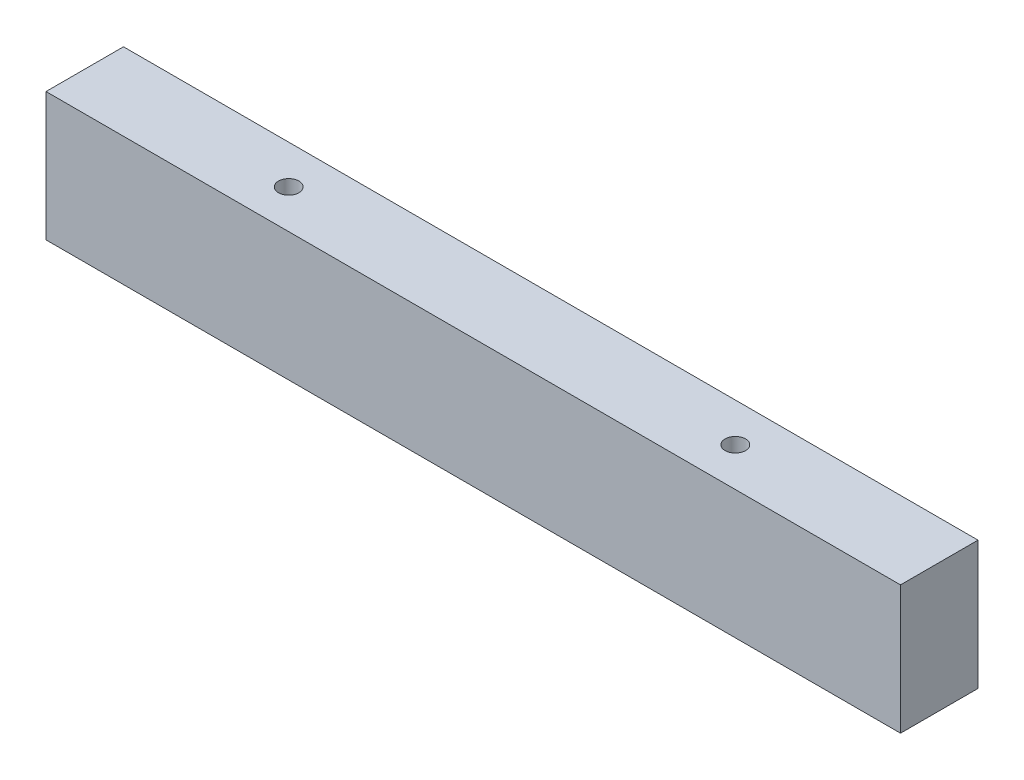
ISO-10303-21;
HEADER;
FILE_DESCRIPTION(('STEP AP214'),'2;1');
FILE_NAME('part.step','',(''),(''),'','','');
FILE_SCHEMA(('AUTOMOTIVE_DESIGN { 1 0 10303 214 1 1 1 1 }'));
ENDSEC;
DATA;
#1=APPLICATION_CONTEXT('core data for automotive mechanical design processes');
#2=APPLICATION_PROTOCOL_DEFINITION('international standard','automotive_design',2000,#1);
#3=PRODUCT_CONTEXT('',#1,'mechanical');
#4=PRODUCT('Part','Part','',(#3));
#5=PRODUCT_RELATED_PRODUCT_CATEGORY('part','',(#4));
#6=PRODUCT_DEFINITION_FORMATION('','',#4);
#7=PRODUCT_DEFINITION_CONTEXT('part definition',#1,'design');
#8=PRODUCT_DEFINITION('design','',#6,#7);
#9=PRODUCT_DEFINITION_SHAPE('','',#8);
#10=(LENGTH_UNIT() NAMED_UNIT(*) SI_UNIT(.MILLI.,.METRE.));
#11=(NAMED_UNIT(*) PLANE_ANGLE_UNIT() SI_UNIT($,.RADIAN.));
#12=(NAMED_UNIT(*) SI_UNIT($,.STERADIAN.) SOLID_ANGLE_UNIT());
#13=UNCERTAINTY_MEASURE_WITH_UNIT(LENGTH_MEASURE(1.E-05),#10,'distance_accuracy_value','');
#14=(GEOMETRIC_REPRESENTATION_CONTEXT(3) GLOBAL_UNCERTAINTY_ASSIGNED_CONTEXT((#13)) GLOBAL_UNIT_ASSIGNED_CONTEXT((#10,
#11,#12)) REPRESENTATION_CONTEXT('',''));
#15=CARTESIAN_POINT('',(0.,0.,0.));
#16=DIRECTION('',(0.,0.,1.));
#17=DIRECTION('',(1.,0.,0.));
#18=AXIS2_PLACEMENT_3D('',#15,#16,#17);
#19=CARTESIAN_POINT('',(0.,0.,38.));
#20=DIRECTION('',(1.,0.,0.));
#21=DIRECTION('',(0.,0.,-1.));
#22=AXIS2_PLACEMENT_3D('',#19,#20,#21);
#23=PLANE('',#22);
#24=DIRECTION('',(0.,-1.,0.));
#25=VECTOR('',#24,1.);
#26=CARTESIAN_POINT('',(0.,0.,0.));
#27=LINE('',#26,#25);
#28=CARTESIAN_POINT('',(0.,63.,0.));
#29=VERTEX_POINT('',#28);
#30=CARTESIAN_POINT('',(0.,0.,0.));
#31=VERTEX_POINT('',#30);
#32=EDGE_CURVE('E98',#29,#31,#27,.T.);
#33=ORIENTED_EDGE('',*,*,#32,.T.);
#34=DIRECTION('',(0.,0.,-1.));
#35=VECTOR('',#34,1.);
#36=CARTESIAN_POINT('',(0.,0.,38.));
#37=LINE('',#36,#35);
#38=CARTESIAN_POINT('',(0.,0.,38.));
#39=VERTEX_POINT('',#38);
#40=EDGE_CURVE('E11',#39,#31,#37,.T.);
#41=ORIENTED_EDGE('',*,*,#40,.F.);
#42=DIRECTION('',(0.,-1.,0.));
#43=VECTOR('',#42,1.);
#44=CARTESIAN_POINT('',(0.,0.,38.));
#45=LINE('',#44,#43);
#46=CARTESIAN_POINT('',(0.,63.,38.));
#47=VERTEX_POINT('',#46);
#48=EDGE_CURVE('E86',#47,#39,#45,.T.);
#49=ORIENTED_EDGE('',*,*,#48,.F.);
#50=DIRECTION('',(0.,0.,-1.));
#51=VECTOR('',#50,1.);
#52=CARTESIAN_POINT('',(0.,63.,38.));
#53=LINE('',#52,#51);
#54=EDGE_CURVE('E94',#47,#29,#53,.T.);
#55=ORIENTED_EDGE('',*,*,#54,.T.);
#56=EDGE_LOOP('',(#33,#41,#49,#55));
#57=FACE_BOUND('',#56,.T.);
#58=ADVANCED_FACE('F35',(#57),#23,.F.);
#59=CARTESIAN_POINT('',(0.,0.,38.));
#60=DIRECTION('',(0.,1.,0.));
#61=DIRECTION('',(0.,0.,1.));
#62=AXIS2_PLACEMENT_3D('',#59,#60,#61);
#63=PLANE('',#62);
#64=CARTESIAN_POINT('',(100.,0.,19.));
#65=DIRECTION('',(0.,1.,0.));
#66=DIRECTION('',(0.,0.,1.));
#67=AXIS2_PLACEMENT_3D('',#64,#65,#66);
#68=CIRCLE('',#67,5.0000000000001);
#69=CARTESIAN_POINT('',(100.,0.,24.0000000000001));
#70=VERTEX_POINT('',#69);
#71=EDGE_CURVE('E101',#70,#70,#68,.F.);
#72=ORIENTED_EDGE('',*,*,#71,.F.);
#73=EDGE_LOOP('',(#72));
#74=FACE_BOUND('',#73,.T.);
#75=CARTESIAN_POINT('',(319.,0.,19.));
#76=DIRECTION('',(0.,1.,0.));
#77=DIRECTION('',(0.,0.,1.));
#78=AXIS2_PLACEMENT_3D('',#75,#76,#77);
#79=CIRCLE('',#78,4.99999999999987);
#80=CARTESIAN_POINT('',(319.,0.,23.9999999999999));
#81=VERTEX_POINT('',#80);
#82=EDGE_CURVE('E112',#81,#81,#79,.F.);
#83=ORIENTED_EDGE('',*,*,#82,.F.);
#84=EDGE_LOOP('',(#83));
#85=FACE_BOUND('',#84,.T.);
#86=DIRECTION('',(1.,0.,0.));
#87=VECTOR('',#86,1.);
#88=CARTESIAN_POINT('',(0.,0.,0.));
#89=LINE('',#88,#87);
#90=CARTESIAN_POINT('',(419.,0.,0.));
#91=VERTEX_POINT('',#90);
#92=EDGE_CURVE('E90',#31,#91,#89,.T.);
#93=ORIENTED_EDGE('',*,*,#92,.T.);
#94=DIRECTION('',(0.,0.,-1.));
#95=VECTOR('',#94,1.);
#96=CARTESIAN_POINT('',(419.,0.,38.));
#97=LINE('',#96,#95);
#98=CARTESIAN_POINT('',(419.,0.,38.));
#99=VERTEX_POINT('',#98);
#100=EDGE_CURVE('E43',#99,#91,#97,.T.);
#101=ORIENTED_EDGE('',*,*,#100,.F.);
#102=DIRECTION('',(1.,0.,0.));
#103=VECTOR('',#102,1.);
#104=CARTESIAN_POINT('',(0.,0.,38.));
#105=LINE('',#104,#103);
#106=EDGE_CURVE('E81',#39,#99,#105,.T.);
#107=ORIENTED_EDGE('',*,*,#106,.F.);
#108=ORIENTED_EDGE('',*,*,#40,.T.);
#109=EDGE_LOOP('',(#93,#101,#107,#108));
#110=FACE_BOUND('',#109,.T.);
#111=ADVANCED_FACE('F89',(#74,#85,#110),#63,.F.);
#112=CARTESIAN_POINT('',(419.,0.,38.));
#113=DIRECTION('',(-1.,0.,0.));
#114=DIRECTION('',(0.,0.,1.));
#115=AXIS2_PLACEMENT_3D('',#112,#113,#114);
#116=PLANE('',#115);
#117=DIRECTION('',(0.,1.,0.));
#118=VECTOR('',#117,1.);
#119=CARTESIAN_POINT('',(419.,0.,0.));
#120=LINE('',#119,#118);
#121=CARTESIAN_POINT('',(419.,63.,0.));
#122=VERTEX_POINT('',#121);
#123=EDGE_CURVE('E68',#91,#122,#120,.T.);
#124=ORIENTED_EDGE('',*,*,#123,.T.);
#125=DIRECTION('',(0.,0.,-1.));
#126=VECTOR('',#125,1.);
#127=CARTESIAN_POINT('',(419.,63.,38.));
#128=LINE('',#127,#126);
#129=CARTESIAN_POINT('',(419.,63.,38.));
#130=VERTEX_POINT('',#129);
#131=EDGE_CURVE('E91',#130,#122,#128,.T.);
#132=ORIENTED_EDGE('',*,*,#131,.F.);
#133=DIRECTION('',(0.,1.,0.));
#134=VECTOR('',#133,1.);
#135=CARTESIAN_POINT('',(419.,0.,38.));
#136=LINE('',#135,#134);
#137=EDGE_CURVE('E84',#99,#130,#136,.T.);
#138=ORIENTED_EDGE('',*,*,#137,.F.);
#139=ORIENTED_EDGE('',*,*,#100,.T.);
#140=EDGE_LOOP('',(#124,#132,#138,#139));
#141=FACE_BOUND('',#140,.T.);
#142=ADVANCED_FACE('F92',(#141),#116,.F.);
#143=CARTESIAN_POINT('',(0.,63.,38.));
#144=DIRECTION('',(0.,-1.,0.));
#145=DIRECTION('',(0.,0.,-1.));
#146=AXIS2_PLACEMENT_3D('',#143,#144,#145);
#147=PLANE('',#146);
#148=CARTESIAN_POINT('',(100.,63.,19.));
#149=DIRECTION('',(0.,1.,0.));
#150=DIRECTION('',(0.,0.,1.));
#151=AXIS2_PLACEMENT_3D('',#148,#149,#150);
#152=CIRCLE('',#151,5.0000000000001);
#153=CARTESIAN_POINT('',(100.,63.,24.0000000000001));
#154=VERTEX_POINT('',#153);
#155=EDGE_CURVE('E115',#154,#154,#152,.T.);
#156=ORIENTED_EDGE('',*,*,#155,.F.);
#157=EDGE_LOOP('',(#156));
#158=FACE_BOUND('',#157,.T.);
#159=CARTESIAN_POINT('',(319.,63.,19.));
#160=DIRECTION('',(0.,1.,0.));
#161=DIRECTION('',(0.,0.,1.));
#162=AXIS2_PLACEMENT_3D('',#159,#160,#161);
#163=CIRCLE('',#162,4.99999999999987);
#164=CARTESIAN_POINT('',(319.,63.,23.9999999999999));
#165=VERTEX_POINT('',#164);
#166=EDGE_CURVE('E116',#165,#165,#163,.T.);
#167=ORIENTED_EDGE('',*,*,#166,.F.);
#168=EDGE_LOOP('',(#167));
#169=FACE_BOUND('',#168,.T.);
#170=DIRECTION('',(-1.,0.,0.));
#171=VECTOR('',#170,1.);
#172=CARTESIAN_POINT('',(0.,63.,0.));
#173=LINE('',#172,#171);
#174=EDGE_CURVE('E74',#122,#29,#173,.T.);
#175=ORIENTED_EDGE('',*,*,#174,.T.);
#176=ORIENTED_EDGE('',*,*,#54,.F.);
#177=DIRECTION('',(-1.,0.,0.));
#178=VECTOR('',#177,1.);
#179=CARTESIAN_POINT('',(0.,63.,38.));
#180=LINE('',#179,#178);
#181=EDGE_CURVE('E51',#130,#47,#180,.T.);
#182=ORIENTED_EDGE('',*,*,#181,.F.);
#183=ORIENTED_EDGE('',*,*,#131,.T.);
#184=EDGE_LOOP('',(#175,#176,#182,#183));
#185=FACE_BOUND('',#184,.T.);
#186=ADVANCED_FACE('F106',(#158,#169,#185),#147,.F.);
#187=CARTESIAN_POINT('',(0.,0.,38.));
#188=DIRECTION('',(0.,0.,-1.));
#189=DIRECTION('',(-1.,0.,0.));
#190=AXIS2_PLACEMENT_3D('',#187,#188,#189);
#191=PLANE('',#190);
#192=ORIENTED_EDGE('',*,*,#48,.T.);
#193=ORIENTED_EDGE('',*,*,#106,.T.);
#194=ORIENTED_EDGE('',*,*,#137,.T.);
#195=ORIENTED_EDGE('',*,*,#181,.T.);
#196=EDGE_LOOP('',(#192,#193,#194,#195));
#197=FACE_BOUND('',#196,.T.);
#198=ADVANCED_FACE('F82',(#197),#191,.F.);
#199=CARTESIAN_POINT('',(0.,0.,0.));
#200=DIRECTION('',(0.,0.,-1.));
#201=DIRECTION('',(-1.,0.,0.));
#202=AXIS2_PLACEMENT_3D('',#199,#200,#201);
#203=PLANE('',#202);
#204=ORIENTED_EDGE('',*,*,#32,.F.);
#205=ORIENTED_EDGE('',*,*,#174,.F.);
#206=ORIENTED_EDGE('',*,*,#123,.F.);
#207=ORIENTED_EDGE('',*,*,#92,.F.);
#208=EDGE_LOOP('',(#204,#205,#206,#207));
#209=FACE_BOUND('',#208,.T.);
#210=ADVANCED_FACE('F109',(#209),#203,.T.);
#211=CARTESIAN_POINT('',(319.,-0.001000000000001,19.));
#212=DIRECTION('',(0.,1.,0.));
#213=DIRECTION('',(0.,0.,1.));
#214=AXIS2_PLACEMENT_3D('',#211,#212,#213);
#215=CYLINDRICAL_SURFACE('',#214,4.99999999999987);
#216=ORIENTED_EDGE('',*,*,#166,.T.);
#217=EDGE_LOOP('',(#216));
#218=FACE_BOUND('',#217,.T.);
#219=ORIENTED_EDGE('',*,*,#82,.T.);
#220=EDGE_LOOP('',(#219));
#221=FACE_BOUND('',#220,.T.);
#222=ADVANCED_FACE('F132',(#218,#221),#215,.F.);
#223=CARTESIAN_POINT('',(100.,-0.001000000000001,19.));
#224=DIRECTION('',(0.,1.,0.));
#225=DIRECTION('',(0.,0.,1.));
#226=AXIS2_PLACEMENT_3D('',#223,#224,#225);
#227=CYLINDRICAL_SURFACE('',#226,5.0000000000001);
#228=ORIENTED_EDGE('',*,*,#155,.T.);
#229=EDGE_LOOP('',(#228));
#230=FACE_BOUND('',#229,.T.);
#231=ORIENTED_EDGE('',*,*,#71,.T.);
#232=EDGE_LOOP('',(#231));
#233=FACE_BOUND('',#232,.T.);
#234=ADVANCED_FACE('F124',(#230,#233),#227,.F.);
#235=CLOSED_SHELL('',(#58,#111,#142,#186,#198,#210,#222,#234));
#236=MANIFOLD_SOLID_BREP('B2',#235);
#237=ADVANCED_BREP_SHAPE_REPRESENTATION('',(#18,#236),#14);
#238=SHAPE_DEFINITION_REPRESENTATION(#9,#237);
ENDSEC;
END-ISO-10303-21;
